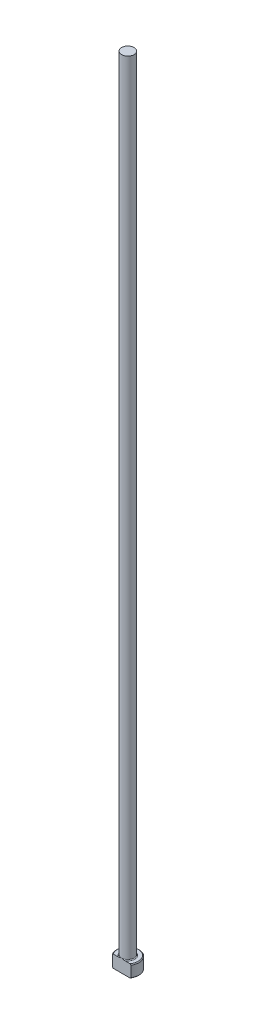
ISO-10303-21;
HEADER;
FILE_DESCRIPTION(('STEP AP214'),'2;1');
FILE_NAME('part.step','',(''),(''),'','','');
FILE_SCHEMA(('AUTOMOTIVE_DESIGN { 1 0 10303 214 1 1 1 1 }'));
ENDSEC;
DATA;
#1=APPLICATION_CONTEXT('core data for automotive mechanical design processes');
#2=APPLICATION_PROTOCOL_DEFINITION('international standard','automotive_design',2000,#1);
#3=PRODUCT_CONTEXT('',#1,'mechanical');
#4=PRODUCT('Part','Part','',(#3));
#5=PRODUCT_RELATED_PRODUCT_CATEGORY('part','',(#4));
#6=PRODUCT_DEFINITION_FORMATION('','',#4);
#7=PRODUCT_DEFINITION_CONTEXT('part definition',#1,'design');
#8=PRODUCT_DEFINITION('design','',#6,#7);
#9=PRODUCT_DEFINITION_SHAPE('','',#8);
#10=(LENGTH_UNIT() NAMED_UNIT(*) SI_UNIT(.MILLI.,.METRE.));
#11=(NAMED_UNIT(*) PLANE_ANGLE_UNIT() SI_UNIT($,.RADIAN.));
#12=(NAMED_UNIT(*) SI_UNIT($,.STERADIAN.) SOLID_ANGLE_UNIT());
#13=UNCERTAINTY_MEASURE_WITH_UNIT(LENGTH_MEASURE(1.E-05),#10,'distance_accuracy_value','');
#14=(GEOMETRIC_REPRESENTATION_CONTEXT(3) GLOBAL_UNCERTAINTY_ASSIGNED_CONTEXT((#13)) GLOBAL_UNIT_ASSIGNED_CONTEXT((#10,
#11,#12)) REPRESENTATION_CONTEXT('',''));
#15=CARTESIAN_POINT('',(0.,0.,0.));
#16=DIRECTION('',(0.,0.,1.));
#17=DIRECTION('',(1.,0.,0.));
#18=AXIS2_PLACEMENT_3D('',#15,#16,#17);
#19=CARTESIAN_POINT('',(0.,0.,0.));
#20=DIRECTION('',(0.,-1.,0.));
#21=DIRECTION('',(0.,0.,-1.));
#22=AXIS2_PLACEMENT_3D('',#19,#20,#21);
#23=PLANE('',#22);
#24=DIRECTION('',(1.,0.,0.));
#25=VECTOR('',#24,1.);
#26=CARTESIAN_POINT('',(-2.96654602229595,0.,1.98373999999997));
#27=LINE('',#26,#25);
#28=CARTESIAN_POINT('',(-2.65556240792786,0.,1.98373999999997));
#29=VERTEX_POINT('',#28);
#30=CARTESIAN_POINT('',(2.65556240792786,0.,1.98373999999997));
#31=VERTEX_POINT('',#30);
#32=EDGE_CURVE('E92',#29,#31,#27,.T.);
#33=ORIENTED_EDGE('',*,*,#32,.F.);
#34=CARTESIAN_POINT('',(0.,0.,0.));
#35=DIRECTION('',(0.,-1.,0.));
#36=DIRECTION('',(0.,0.,-1.));
#37=AXIS2_PLACEMENT_3D('',#34,#35,#36);
#38=CIRCLE('',#37,3.31469999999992);
#39=EDGE_CURVE('E105',#29,#31,#38,.T.);
#40=ORIENTED_EDGE('',*,*,#39,.T.);
#41=EDGE_LOOP('',(#33,#40));
#42=FACE_BOUND('',#41,.T.);
#43=ADVANCED_FACE('F37',(#42),#23,.T.);
#44=CARTESIAN_POINT('',(0.,259.958771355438,0.));
#45=DIRECTION('',(0.,1.,0.));
#46=DIRECTION('',(0.,0.,1.));
#47=AXIS2_PLACEMENT_3D('',#44,#45,#46);
#48=CYLINDRICAL_SURFACE('',#47,3.56869999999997);
#49=DIRECTION('',(0.,-1.,0.));
#50=VECTOR('',#49,1.);
#51=CARTESIAN_POINT('',(-2.96654602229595,254.,1.98373999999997));
#52=LINE('',#51,#50);
#53=CARTESIAN_POINT('',(-2.96654602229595,3.7084,1.98373999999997));
#54=VERTEX_POINT('',#53);
#55=CARTESIAN_POINT('',(-2.96654602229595,0.254000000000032,1.98373999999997));
#56=VERTEX_POINT('',#55);
#57=EDGE_CURVE('E95',#54,#56,#52,.T.);
#58=ORIENTED_EDGE('',*,*,#57,.F.);
#59=CARTESIAN_POINT('',(0.,3.7084,0.));
#60=DIRECTION('',(0.,1.,0.));
#61=DIRECTION('',(0.,0.,1.));
#62=AXIS2_PLACEMENT_3D('',#59,#60,#61);
#63=CIRCLE('',#62,3.56869999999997);
#64=CARTESIAN_POINT('',(2.96654602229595,3.7084,1.98373999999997));
#65=VERTEX_POINT('',#64);
#66=EDGE_CURVE('E109',#54,#65,#63,.F.);
#67=ORIENTED_EDGE('',*,*,#66,.T.);
#68=DIRECTION('',(0.,-1.,0.));
#69=VECTOR('',#68,1.);
#70=CARTESIAN_POINT('',(2.96654602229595,254.,1.98373999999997));
#71=LINE('',#70,#69);
#72=CARTESIAN_POINT('',(2.96654602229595,0.254000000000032,1.98373999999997));
#73=VERTEX_POINT('',#72);
#74=EDGE_CURVE('E187',#65,#73,#71,.T.);
#75=ORIENTED_EDGE('',*,*,#74,.T.);
#76=CARTESIAN_POINT('',(0.,0.254000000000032,0.));
#77=DIRECTION('',(0.,-1.,0.));
#78=DIRECTION('',(0.,0.,-1.));
#79=AXIS2_PLACEMENT_3D('',#76,#77,#78);
#80=CIRCLE('',#79,3.56869999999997);
#81=EDGE_CURVE('E115',#73,#56,#80,.F.);
#82=ORIENTED_EDGE('',*,*,#81,.T.);
#83=EDGE_LOOP('',(#58,#67,#75,#82));
#84=FACE_BOUND('',#83,.T.);
#85=ADVANCED_FACE('F160',(#84),#48,.T.);
#86=CARTESIAN_POINT('',(-3.56869999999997,3.9624,0.));
#87=DIRECTION('',(0.,1.,0.));
#88=DIRECTION('',(0.,0.,1.));
#89=AXIS2_PLACEMENT_3D('',#86,#87,#88);
#90=PLANE('',#89);
#91=DIRECTION('',(-1.,0.,0.));
#92=VECTOR('',#91,1.);
#93=CARTESIAN_POINT('',(-3.56869999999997,3.9624,1.98373999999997));
#94=LINE('',#93,#92);
#95=CARTESIAN_POINT('',(2.6555624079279,3.9624,1.98373999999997));
#96=VERTEX_POINT('',#95);
#97=CARTESIAN_POINT('',(1.03549790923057,3.9624,1.9837399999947));
#98=VERTEX_POINT('',#97);
#99=EDGE_CURVE('E58',#96,#98,#94,.T.);
#100=ORIENTED_EDGE('',*,*,#99,.F.);
#101=CARTESIAN_POINT('',(0.,3.9624,0.));
#102=DIRECTION('',(0.,1.,0.));
#103=DIRECTION('',(0.,0.,1.));
#104=AXIS2_PLACEMENT_3D('',#101,#102,#103);
#105=CIRCLE('',#104,3.31469999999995);
#106=CARTESIAN_POINT('',(-2.6555624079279,3.9624,1.98373999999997));
#107=VERTEX_POINT('',#106);
#108=EDGE_CURVE('E182',#96,#107,#105,.T.);
#109=ORIENTED_EDGE('',*,*,#108,.T.);
#110=CARTESIAN_POINT('',(-1.03549790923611,3.96240000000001,1.98373999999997));
#111=VERTEX_POINT('',#110);
#112=EDGE_CURVE('E140',#111,#107,#94,.T.);
#113=ORIENTED_EDGE('',*,*,#112,.F.);
#114=CARTESIAN_POINT('',(0.,3.9624,0.));
#115=DIRECTION('',(0.,1.,0.));
#116=DIRECTION('',(0.,0.,1.));
#117=AXIS2_PLACEMENT_3D('',#114,#115,#116);
#118=CIRCLE('',#117,2.23773999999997);
#119=EDGE_CURVE('E112',#111,#98,#118,.F.);
#120=ORIENTED_EDGE('',*,*,#119,.T.);
#121=EDGE_LOOP('',(#100,#109,#113,#120));
#122=FACE_BOUND('',#121,.T.);
#123=ADVANCED_FACE('F164',(#122),#90,.T.);
#124=CARTESIAN_POINT('',(0.,259.958771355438,0.));
#125=DIRECTION('',(0.,1.,0.));
#126=DIRECTION('',(0.,0.,1.));
#127=AXIS2_PLACEMENT_3D('',#124,#125,#126);
#128=CYLINDRICAL_SURFACE('',#127,1.98373999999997);
#129=CARTESIAN_POINT('',(0.,4.21640000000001,0.));
#130=DIRECTION('',(0.,1.,0.));
#131=DIRECTION('',(0.,0.,1.));
#132=AXIS2_PLACEMENT_3D('',#129,#130,#131);
#133=CIRCLE('',#132,1.98373999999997);
#134=CARTESIAN_POINT('',(0.,4.21640000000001,1.98373999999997));
#135=VERTEX_POINT('',#134);
#136=EDGE_CURVE('E108',#135,#135,#133,.T.);
#137=ORIENTED_EDGE('',*,*,#136,.T.);
#138=EDGE_LOOP('',(#137));
#139=FACE_BOUND('',#138,.T.);
#140=CARTESIAN_POINT('',(0.,254.,0.));
#141=DIRECTION('',(0.,1.,0.));
#142=DIRECTION('',(0.,0.,1.));
#143=AXIS2_PLACEMENT_3D('',#140,#141,#142);
#144=CIRCLE('',#143,1.98373999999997);
#145=CARTESIAN_POINT('',(0.,254.,1.98373999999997));
#146=VERTEX_POINT('',#145);
#147=EDGE_CURVE('E100',#146,#146,#144,.T.);
#148=ORIENTED_EDGE('',*,*,#147,.F.);
#149=EDGE_LOOP('',(#148));
#150=FACE_BOUND('',#149,.T.);
#151=ADVANCED_FACE('F169',(#139,#150),#128,.T.);
#152=CARTESIAN_POINT('',(-1.98373999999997,254.,0.));
#153=DIRECTION('',(0.,1.,0.));
#154=DIRECTION('',(0.,0.,1.));
#155=AXIS2_PLACEMENT_3D('',#152,#153,#154);
#156=PLANE('',#155);
#157=ORIENTED_EDGE('',*,*,#147,.T.);
#158=EDGE_LOOP('',(#157));
#159=FACE_BOUND('',#158,.T.);
#160=ADVANCED_FACE('F127',(#159),#156,.T.);
#161=CARTESIAN_POINT('',(0.,3.96239999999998,0.));
#162=DIRECTION('',(0.,-1.,0.));
#163=DIRECTION('',(0.,0.,-1.));
#164=AXIS2_PLACEMENT_3D('',#161,#162,#163);
#165=CONICAL_SURFACE('',#164,3.31469999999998,0.78539816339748);
#166=CARTESIAN_POINT('',(2.96724602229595,3.70781809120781,1.98373999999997));
#167=CARTESIAN_POINT('',(2.86672695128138,3.7913253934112,1.98373999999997));
#168=CARTESIAN_POINT('',(2.76560417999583,3.87413188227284,1.98373999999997));
#169=CARTESIAN_POINT('',(2.56161541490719,4.0377668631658,1.98373999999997));
#170=CARTESIAN_POINT('',(2.45874784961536,4.11859339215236,1.98373999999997));
#171=CARTESIAN_POINT('',(2.2484941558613,4.2793883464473,1.98373999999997));
#172=CARTESIAN_POINT('',(2.14105861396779,4.35929251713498,1.98373999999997));
#173=CARTESIAN_POINT('',(1.92334877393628,4.51509190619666,1.98373999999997));
#174=CARTESIAN_POINT('',(1.81307555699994,4.59098861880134,1.98373999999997));
#175=CARTESIAN_POINT('',(1.61917748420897,4.7171926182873,1.98373999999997));
#176=CARTESIAN_POINT('',(1.53643977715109,4.76885588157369,1.98373999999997));
#177=CARTESIAN_POINT('',(1.36853089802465,4.86805297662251,1.98373999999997));
#178=CARTESIAN_POINT('',(1.28336045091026,4.91558802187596,1.98373999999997));
#179=CARTESIAN_POINT('',(1.11060273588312,5.00482765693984,1.98373999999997));
#180=CARTESIAN_POINT('',(1.0230321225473,5.04656410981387,1.98373999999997));
#181=CARTESIAN_POINT('',(0.844684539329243,5.12251752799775,1.98373999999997));
#182=CARTESIAN_POINT('',(0.753910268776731,5.15674065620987,1.98373999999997));
#183=CARTESIAN_POINT('',(0.603497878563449,5.20432307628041,1.98373999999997));
#184=CARTESIAN_POINT('',(0.544819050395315,5.22071027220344,1.98373999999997));
#185=CARTESIAN_POINT('',(0.426373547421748,5.24887069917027,1.98373999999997));
#186=CARTESIAN_POINT('',(0.366607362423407,5.26064595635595,1.98373999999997));
#187=CARTESIAN_POINT('',(0.246447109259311,5.27898890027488,1.98373999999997));
#188=CARTESIAN_POINT('',(0.186055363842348,5.28557158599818,1.98373999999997));
#189=CARTESIAN_POINT('',(0.0649198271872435,5.29321823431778,1.98373999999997));
#190=CARTESIAN_POINT('',(0.00417605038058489,5.29428242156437,1.98373999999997));
#191=CARTESIAN_POINT('',(-0.117214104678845,5.29082761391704,1.98373999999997));
#192=CARTESIAN_POINT('',(-0.177860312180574,5.28630271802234,1.98373999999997));
#193=CARTESIAN_POINT('',(-0.298512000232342,5.27192078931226,1.98373999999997));
#194=CARTESIAN_POINT('',(-0.358517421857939,5.2620632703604,1.98373999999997));
#195=CARTESIAN_POINT('',(-0.477735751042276,5.2374830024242,1.98373999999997));
#196=CARTESIAN_POINT('',(-0.536945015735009,5.22274281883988,1.98373999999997));
#197=CARTESIAN_POINT('',(-0.654133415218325,5.18904660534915,1.98373999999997));
#198=CARTESIAN_POINT('',(-0.712112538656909,5.1700905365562,1.98373999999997));
#199=CARTESIAN_POINT('',(-0.904629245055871,5.10048538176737,1.98373999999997));
#200=CARTESIAN_POINT('',(-1.03624061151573,5.04174784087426,1.98373999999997));
#201=CARTESIAN_POINT('',(-1.29313693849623,4.91170252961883,1.98373999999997));
#202=CARTESIAN_POINT('',(-1.41840716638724,4.84036707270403,1.98373999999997));
#203=CARTESIAN_POINT('',(-1.66480293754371,4.68918546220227,1.98373999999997));
#204=CARTESIAN_POINT('',(-1.78589487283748,4.60928521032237,1.98373999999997));
#205=CARTESIAN_POINT('',(-2.02421015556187,4.44420594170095,1.98373999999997));
#206=CARTESIAN_POINT('',(-2.14143690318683,4.35903176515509,1.98373999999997));
#207=CARTESIAN_POINT('',(-2.37887141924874,4.18067980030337,1.98373999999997));
#208=CARTESIAN_POINT('',(-2.49893764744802,4.0873146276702,1.98373999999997));
#209=CARTESIAN_POINT('',(-2.67660513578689,3.94570491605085,1.98373999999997));
#210=CARTESIAN_POINT('',(-2.73507077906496,3.89853553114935,1.98373999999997));
#211=CARTESIAN_POINT('',(-2.85150939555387,3.80360086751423,1.98373999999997));
#212=CARTESIAN_POINT('',(-2.90948240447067,3.75583563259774,1.98373999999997));
#213=CARTESIAN_POINT('',(-2.96724602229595,3.70781809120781,1.98373999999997));
#214=B_SPLINE_CURVE_WITH_KNOTS('',3,(#166,#167,#168,#169,#170,#171,#172,#173,#174,#175,#176,
#177,#178,#179,#180,#181,#182,#183,#184,#185,#186,#187,#188,#189,#190,#191,#192,#193,#194,#195,
#196,#197,#198,#199,#200,#201,#202,#203,#204,#205,#206,#207,#208,#209,#210,#211,#212,#213),
.UNSPECIFIED.,.F.,.F.,(4,2,2,2,2,2,2,2,2,2,2,2,2,2,2,2,2,2,2,2,2,2,2,4),(0.,0.39206528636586,
0.784504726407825,1.1861202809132,1.58758501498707,1.88012833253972,2.17258536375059,
2.46336577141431,2.75390676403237,2.93652450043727,3.11906191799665,3.30107011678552,
3.48307090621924,3.66526401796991,3.84747374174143,4.0303412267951,4.2132103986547,
4.64434716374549,5.07644350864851,5.51145085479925,5.94606472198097,6.40228573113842,
6.62764643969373,6.85299067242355),.UNSPECIFIED.);
#215=EDGE_CURVE('E63',#65,#96,#214,.T.);
#216=ORIENTED_EDGE('',*,*,#215,.F.);
#217=ORIENTED_EDGE('',*,*,#66,.F.);
#218=EDGE_CURVE('E133',#107,#54,#214,.T.);
#219=ORIENTED_EDGE('',*,*,#218,.F.);
#220=ORIENTED_EDGE('',*,*,#108,.F.);
#221=EDGE_LOOP('',(#216,#217,#219,#220));
#222=FACE_BOUND('',#221,.T.);
#223=ADVANCED_FACE('F147',(#222),#165,.T.);
#224=CARTESIAN_POINT('',(0.,0.254000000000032,0.));
#225=DIRECTION('',(0.,1.,0.));
#226=DIRECTION('',(0.,0.,1.));
#227=AXIS2_PLACEMENT_3D('',#224,#225,#226);
#228=CONICAL_SURFACE('',#227,3.56869999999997,0.78539816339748);
#229=CARTESIAN_POINT('',(-2.96724602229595,0.254581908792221,1.98373999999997));
#230=CARTESIAN_POINT('',(-2.86672695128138,0.171074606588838,1.98373999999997));
#231=CARTESIAN_POINT('',(-2.76560417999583,0.0882681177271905,1.98373999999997));
#232=CARTESIAN_POINT('',(-2.56161541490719,-0.0753668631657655,1.98373999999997));
#233=CARTESIAN_POINT('',(-2.45874784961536,-0.156193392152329,1.98373999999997));
#234=CARTESIAN_POINT('',(-2.2484941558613,-0.316988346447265,1.98373999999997));
#235=CARTESIAN_POINT('',(-2.14105861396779,-0.396892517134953,1.98373999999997));
#236=CARTESIAN_POINT('',(-1.92334877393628,-0.552691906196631,1.98373999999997));
#237=CARTESIAN_POINT('',(-1.81307555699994,-0.628588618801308,1.98373999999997));
#238=CARTESIAN_POINT('',(-1.61917748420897,-0.754792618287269,1.98373999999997));
#239=CARTESIAN_POINT('',(-1.53643977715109,-0.80645588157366,1.98373999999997));
#240=CARTESIAN_POINT('',(-1.36853089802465,-0.905652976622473,1.98373999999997));
#241=CARTESIAN_POINT('',(-1.28336045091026,-0.953188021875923,1.98373999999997));
#242=CARTESIAN_POINT('',(-1.11060273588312,-1.04242765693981,1.98373999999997));
#243=CARTESIAN_POINT('',(-1.0230321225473,-1.08416410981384,1.98373999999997));
#244=CARTESIAN_POINT('',(-0.844684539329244,-1.16011752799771,1.98373999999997));
#245=CARTESIAN_POINT('',(-0.753910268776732,-1.19434065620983,1.98373999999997));
#246=CARTESIAN_POINT('',(-0.603497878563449,-1.24192307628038,1.98373999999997));
#247=CARTESIAN_POINT('',(-0.544819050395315,-1.2583102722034,1.98373999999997));
#248=CARTESIAN_POINT('',(-0.426373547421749,-1.28647069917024,1.98373999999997));
#249=CARTESIAN_POINT('',(-0.366607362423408,-1.29824595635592,1.98373999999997));
#250=CARTESIAN_POINT('',(-0.246447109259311,-1.31658890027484,1.98373999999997));
#251=CARTESIAN_POINT('',(-0.186055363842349,-1.32317158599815,1.98373999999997));
#252=CARTESIAN_POINT('',(-0.0649198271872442,-1.33081823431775,1.98373999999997));
#253=CARTESIAN_POINT('',(-0.00417605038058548,-1.33188242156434,1.98373999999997));
#254=CARTESIAN_POINT('',(0.117214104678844,-1.32842761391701,1.98373999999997));
#255=CARTESIAN_POINT('',(0.177860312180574,-1.32390271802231,1.98373999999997));
#256=CARTESIAN_POINT('',(0.298512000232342,-1.30952078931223,1.98373999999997));
#257=CARTESIAN_POINT('',(0.358517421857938,-1.29966327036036,1.98373999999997));
#258=CARTESIAN_POINT('',(0.477735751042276,-1.27508300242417,1.98373999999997));
#259=CARTESIAN_POINT('',(0.536945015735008,-1.26034281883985,1.98373999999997));
#260=CARTESIAN_POINT('',(0.654133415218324,-1.22664660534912,1.98373999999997));
#261=CARTESIAN_POINT('',(0.712112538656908,-1.20769053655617,1.98373999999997));
#262=CARTESIAN_POINT('',(0.904629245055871,-1.13808538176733,1.98373999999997));
#263=CARTESIAN_POINT('',(1.03624061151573,-1.07934784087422,1.98373999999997));
#264=CARTESIAN_POINT('',(1.29313693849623,-0.949302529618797,1.98373999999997));
#265=CARTESIAN_POINT('',(1.41840716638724,-0.877967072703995,1.98373999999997));
#266=CARTESIAN_POINT('',(1.66480293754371,-0.726785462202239,1.98373999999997));
#267=CARTESIAN_POINT('',(1.78589487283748,-0.646885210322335,1.98373999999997));
#268=CARTESIAN_POINT('',(2.02421015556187,-0.48180594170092,1.98373999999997));
#269=CARTESIAN_POINT('',(2.14143690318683,-0.396631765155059,1.98373999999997));
#270=CARTESIAN_POINT('',(2.37887141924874,-0.218279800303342,1.98373999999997));
#271=CARTESIAN_POINT('',(2.49893764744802,-0.124914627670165,1.98373999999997));
#272=CARTESIAN_POINT('',(2.67660513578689,0.0166950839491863,1.98373999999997));
#273=CARTESIAN_POINT('',(2.73507077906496,0.0638644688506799,1.98373999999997));
#274=CARTESIAN_POINT('',(2.85150939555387,0.1587991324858,1.98373999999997));
#275=CARTESIAN_POINT('',(2.90948240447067,0.206564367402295,1.98373999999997));
#276=CARTESIAN_POINT('',(2.96724602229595,0.254581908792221,1.98373999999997));
#277=B_SPLINE_CURVE_WITH_KNOTS('',3,(#229,#230,#231,#232,#233,#234,#235,#236,#237,#238,#239,
#240,#241,#242,#243,#244,#245,#246,#247,#248,#249,#250,#251,#252,#253,#254,#255,#256,#257,#258,
#259,#260,#261,#262,#263,#264,#265,#266,#267,#268,#269,#270,#271,#272,#273,#274,#275,#276),
.UNSPECIFIED.,.F.,.F.,(4,2,2,2,2,2,2,2,2,2,2,2,2,2,2,2,2,2,2,2,2,2,2,4),(0.,0.392065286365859,
0.784504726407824,1.1861202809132,1.58758501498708,1.88012833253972,2.17258536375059,
2.46336577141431,2.75390676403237,2.93652450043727,3.11906191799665,3.30107011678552,
3.48307090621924,3.66526401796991,3.84747374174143,4.0303412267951,4.2132103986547,
4.64434716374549,5.07644350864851,5.51145085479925,5.94606472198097,6.40228573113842,
6.62764643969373,6.85299067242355),.UNSPECIFIED.);
#278=EDGE_CURVE('E89',#56,#29,#277,.T.);
#279=ORIENTED_EDGE('',*,*,#278,.F.);
#280=ORIENTED_EDGE('',*,*,#81,.F.);
#281=EDGE_CURVE('E101',#31,#73,#277,.T.);
#282=ORIENTED_EDGE('',*,*,#281,.F.);
#283=ORIENTED_EDGE('',*,*,#39,.F.);
#284=EDGE_LOOP('',(#279,#280,#282,#283));
#285=FACE_BOUND('',#284,.T.);
#286=ADVANCED_FACE('F107',(#285),#228,.T.);
#287=CARTESIAN_POINT('',(0.,4.21640000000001,0.));
#288=DIRECTION('',(0.,1.,0.));
#289=DIRECTION('',(0.,0.,1.));
#290=AXIS2_PLACEMENT_3D('',#287,#288,#289);
#291=TOROIDAL_SURFACE('',#290,2.23773999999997,0.254);
#292=ORIENTED_EDGE('',*,*,#119,.F.);
#293=CARTESIAN_POINT('',(0.,4.21640000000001,1.98373999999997));
#294=CARTESIAN_POINT('',(4.02307017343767E-11,4.21640057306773,1.98373999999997));
#295=CARTESIAN_POINT('',(-1.40828581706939E-07,4.21640114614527,1.98373999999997));
#296=CARTESIAN_POINT('',(-5.7339269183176E-07,4.21640224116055,1.98373999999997));
#297=CARTESIAN_POINT('',(-8.70731400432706E-07,4.21640276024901,1.98373999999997));
#298=CARTESIAN_POINT('',(-1.58225797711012E-06,4.21640380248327,1.98373999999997));
#299=CARTESIAN_POINT('',(-2.00604119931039E-06,4.21640431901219,1.98373999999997));
#300=CARTESIAN_POINT('',(-2.91133999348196E-06,4.21640528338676,1.98373999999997));
#301=CARTESIAN_POINT('',(-3.39207133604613E-06,4.21640573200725,1.98373999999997));
#302=CARTESIAN_POINT('',(-5.14628594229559E-06,4.21640727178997,1.98373999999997));
#303=CARTESIAN_POINT('',(-6.49332487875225E-06,4.21640828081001,1.98373999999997));
#304=CARTESIAN_POINT('',(-9.24843947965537E-06,4.21641004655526,1.98373999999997));
#305=CARTESIAN_POINT('',(-1.06506929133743E-05,4.21641081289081,1.98373999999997));
#306=CARTESIAN_POINT('',(-1.62369385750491E-05,4.21641377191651,1.98373999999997));
#307=CARTESIAN_POINT('',(-2.04997858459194E-05,4.2164158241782,1.98373999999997));
#308=CARTESIAN_POINT('',(-2.88176617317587E-05,4.21641910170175,1.98373999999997));
#309=CARTESIAN_POINT('',(-3.28481085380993E-05,4.21642039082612,1.98373999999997));
#310=CARTESIAN_POINT('',(-5.03242637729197E-05,4.21642599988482,1.98373999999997));
#311=CARTESIAN_POINT('',(-6.37475444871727E-05,4.21643035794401,1.98373999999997));
#312=CARTESIAN_POINT('',(-8.86866389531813E-05,4.21643721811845,1.98373999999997));
#313=CARTESIAN_POINT('',(-0.000100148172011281,4.21643990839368,1.98373999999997));
#314=CARTESIAN_POINT('',(-0.000184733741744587,4.21646156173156,1.98373999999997));
#315=CARTESIAN_POINT('',(-0.0002551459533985,4.21648964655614,1.98373999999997));
#316=CARTESIAN_POINT('',(-0.000530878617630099,4.21659565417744,1.98373999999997));
#317=CARTESIAN_POINT('',(-0.000738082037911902,4.21666677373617,1.98373999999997));
#318=CARTESIAN_POINT('',(-0.00154925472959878,4.21694925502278,1.98373999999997));
#319=CARTESIAN_POINT('',(-0.00215130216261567,4.21716774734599,1.98373999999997));
#320=CARTESIAN_POINT('',(-0.00462988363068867,4.21806309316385,1.98373999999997));
#321=CARTESIAN_POINT('',(-0.00650853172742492,4.21873189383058,1.98373999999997));
#322=CARTESIAN_POINT('',(-0.0303581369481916,4.22722764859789,1.98373999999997));
#323=CARTESIAN_POINT('',(-0.0523158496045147,4.23510626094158,1.98373999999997));
#324=CARTESIAN_POINT('',(-0.0954269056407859,4.25047917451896,1.98373999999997));
#325=CARTESIAN_POINT('',(-0.11657919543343,4.25797672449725,1.98373999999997));
#326=CARTESIAN_POINT('',(-0.161458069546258,4.27377445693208,1.98373999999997));
#327=CARTESIAN_POINT('',(-0.185188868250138,4.28206294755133,1.98373999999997));
#328=CARTESIAN_POINT('',(-0.232964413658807,4.29853259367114,1.98373999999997));
#329=CARTESIAN_POINT('',(-0.257009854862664,4.30671173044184,1.98373999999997));
#330=CARTESIAN_POINT('',(-0.316193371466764,4.32648112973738,1.98373999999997));
#331=CARTESIAN_POINT('',(-0.3513814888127,4.33792303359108,1.98373999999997));
#332=CARTESIAN_POINT('',(-0.421152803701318,4.35974103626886,1.98373999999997));
#333=CARTESIAN_POINT('',(-0.455729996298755,4.37013624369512,1.98373999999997));
#334=CARTESIAN_POINT('',(-0.532487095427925,4.39200885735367,1.98373999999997));
#335=CARTESIAN_POINT('',(-0.574734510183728,4.4032531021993,1.98373999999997));
#336=CARTESIAN_POINT('',(-0.6600384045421,4.42385016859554,1.98373999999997));
#337=CARTESIAN_POINT('',(-0.703098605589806,4.43318780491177,1.98373999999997));
#338=CARTESIAN_POINT('',(-0.792838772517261,4.44980860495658,1.98373999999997));
#339=CARTESIAN_POINT('',(-0.83955648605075,4.45689590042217,1.98373999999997));
#340=CARTESIAN_POINT('',(-0.933305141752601,4.46701113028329,1.98373999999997));
#341=CARTESIAN_POINT('',(-0.980334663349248,4.47005158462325,1.98373999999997));
#342=CARTESIAN_POINT('',(-1.07363680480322,4.47068781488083,1.98373999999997));
#343=CARTESIAN_POINT('',(-1.11990681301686,4.46838602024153,1.98373999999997));
#344=CARTESIAN_POINT('',(-1.18820667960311,4.45949572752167,1.98373999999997));
#345=CARTESIAN_POINT('',(-1.21059706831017,4.45568261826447,1.98373999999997));
#346=CARTESIAN_POINT('',(-1.25489724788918,4.44592513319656,1.98373999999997));
#347=CARTESIAN_POINT('',(-1.27680769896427,4.43998390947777,1.98373999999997));
#348=CARTESIAN_POINT('',(-1.31298334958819,4.42779727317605,1.98373999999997));
#349=CARTESIAN_POINT('',(-1.32747926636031,4.42223947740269,1.98373999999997));
#350=CARTESIAN_POINT('',(-1.35590450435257,4.40970381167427,1.98373999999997));
#351=CARTESIAN_POINT('',(-1.36983212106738,4.40272199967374,1.98373999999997));
#352=CARTESIAN_POINT('',(-1.39685784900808,4.38707849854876,1.98373999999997));
#353=CARTESIAN_POINT('',(-1.40994935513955,4.37840521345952,1.98373999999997));
#354=CARTESIAN_POINT('',(-1.43467906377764,4.35918713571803,1.98373999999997));
#355=CARTESIAN_POINT('',(-1.44632058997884,4.34864676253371,1.98373999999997));
#356=CARTESIAN_POINT('',(-1.46405523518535,4.32920735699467,1.98373999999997));
#357=CARTESIAN_POINT('',(-1.47073699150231,4.32084820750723,1.98373999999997));
#358=CARTESIAN_POINT('',(-1.48274781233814,4.30319678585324,1.98373999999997));
#359=CARTESIAN_POINT('',(-1.48807744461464,4.29390490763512,1.98373999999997));
#360=CARTESIAN_POINT('',(-1.49706189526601,4.27440249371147,1.98373999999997));
#361=CARTESIAN_POINT('',(-1.50069745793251,4.2641829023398,1.98373999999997));
#362=CARTESIAN_POINT('',(-1.50584635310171,4.24322268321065,1.98373999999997));
#363=CARTESIAN_POINT('',(-1.50736266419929,4.23248280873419,1.98373999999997));
#364=CARTESIAN_POINT('',(-1.50805409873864,4.21251978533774,1.98373999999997));
#365=CARTESIAN_POINT('',(-1.50754134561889,4.2033063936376,1.98373999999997));
#366=CARTESIAN_POINT('',(-1.50490308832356,4.18511471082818,1.98373999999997));
#367=CARTESIAN_POINT('',(-1.50277735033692,4.17613645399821,1.98373999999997));
#368=CARTESIAN_POINT('',(-1.49719456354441,4.15900798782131,1.98373999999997));
#369=CARTESIAN_POINT('',(-1.49379391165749,4.15083904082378,1.98373999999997));
#370=CARTESIAN_POINT('',(-1.48586548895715,4.13507450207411,1.98373999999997));
#371=CARTESIAN_POINT('',(-1.48133740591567,4.12747906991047,1.98373999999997));
#372=CARTESIAN_POINT('',(-1.46862962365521,4.10893969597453,1.98373999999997));
#373=CARTESIAN_POINT('',(-1.45980714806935,4.09843603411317,1.98373999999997));
#374=CARTESIAN_POINT('',(-1.44060965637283,4.07895123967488,1.98373999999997));
#375=CARTESIAN_POINT('',(-1.43023007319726,4.0699747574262,1.98373999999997));
#376=CARTESIAN_POINT('',(-1.40223517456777,4.04875837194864,1.98373999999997));
#377=CARTESIAN_POINT('',(-1.38384742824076,4.03754372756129,1.98373999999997));
#378=CARTESIAN_POINT('',(-1.34565665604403,4.0180221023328,1.98373999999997));
#379=CARTESIAN_POINT('',(-1.32585336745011,4.00971566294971,1.98373999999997));
#380=CARTESIAN_POINT('',(-1.26986203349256,3.98996652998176,1.98373999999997));
#381=CARTESIAN_POINT('',(-1.23279835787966,3.98103330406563,1.98373999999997));
#382=CARTESIAN_POINT('',(-1.15741515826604,3.96843140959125,1.98373999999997));
#383=CARTESIAN_POINT('',(-1.1190855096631,3.96483389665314,1.98373999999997));
#384=CARTESIAN_POINT('',(-1.040510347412,3.96167833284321,1.98373999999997));
#385=CARTESIAN_POINT('',(-1.00025822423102,3.96231482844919,1.98373999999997));
#386=CARTESIAN_POINT('',(-0.919878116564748,3.96702722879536,1.98373999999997));
#387=CARTESIAN_POINT('',(-0.879750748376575,3.97111229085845,1.98373999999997));
#388=CARTESIAN_POINT('',(-0.802049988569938,3.98166551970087,1.98373999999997));
#389=CARTESIAN_POINT('',(-0.764456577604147,3.98799169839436,1.98373999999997));
#390=CARTESIAN_POINT('',(-0.689886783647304,4.00249311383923,1.98373999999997));
#391=CARTESIAN_POINT('',(-0.652907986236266,4.0106561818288,1.98373999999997));
#392=CARTESIAN_POINT('',(-0.571827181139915,4.03026785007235,1.98373999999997));
#393=CARTESIAN_POINT('',(-0.527806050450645,4.04204700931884,1.98373999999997));
#394=CARTESIAN_POINT('',(-0.439166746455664,4.06747597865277,1.98373999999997));
#395=CARTESIAN_POINT('',(-0.394559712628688,4.08116399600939,1.98373999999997));
#396=CARTESIAN_POINT('',(-0.319865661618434,4.10513097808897,1.98373999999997));
#397=CARTESIAN_POINT('',(-0.28968006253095,4.11510679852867,1.98373999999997));
#398=CARTESIAN_POINT('',(-0.229752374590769,4.1353375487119,1.98373999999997));
#399=CARTESIAN_POINT('',(-0.200008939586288,4.14558849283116,1.98373999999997));
#400=CARTESIAN_POINT('',(-0.143797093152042,4.16520591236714,1.98373999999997));
#401=CARTESIAN_POINT('',(-0.117320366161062,4.17454899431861,1.98373999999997));
#402=CARTESIAN_POINT('',(-0.0633624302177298,4.19374573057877,1.98373999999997));
#403=CARTESIAN_POINT('',(-0.0358830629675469,4.20360493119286,1.98373999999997));
#404=CARTESIAN_POINT('',(-0.00650762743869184,4.21406838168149,1.98373999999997));
#405=CARTESIAN_POINT('',(-0.00462809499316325,4.21473753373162,1.98373999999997));
#406=CARTESIAN_POINT('',(-0.00214930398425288,4.21563296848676,1.98373999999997));
#407=CARTESIAN_POINT('',(-0.00154793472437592,4.21585121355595,1.98373999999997));
#408=CARTESIAN_POINT('',(-0.000737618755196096,4.21613339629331,1.98373999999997));
#409=CARTESIAN_POINT('',(-0.000530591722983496,4.21620445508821,1.98373999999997));
#410=CARTESIAN_POINT('',(-0.000255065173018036,4.21631038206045,1.98373999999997));
#411=CARTESIAN_POINT('',(-0.000184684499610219,4.21633845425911,1.98373999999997));
#412=CARTESIAN_POINT('',(-0.000100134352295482,4.21636010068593,1.98373999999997));
#413=CARTESIAN_POINT('',(-8.86750306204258E-05,4.21636279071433,1.98373999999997));
#414=CARTESIAN_POINT('',(-6.37408791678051E-05,4.2163696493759,1.98373999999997));
#415=CARTESIAN_POINT('',(-5.03202712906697E-05,4.21637400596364,1.98373999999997));
#416=CARTESIAN_POINT('',(-3.2847107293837E-05,4.21637961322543,1.98373999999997));
#417=CARTESIAN_POINT('',(-2.88169884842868E-05,4.21638090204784,1.98373999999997));
#418=CARTESIAN_POINT('',(-2.04997436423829E-05,4.21638417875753,1.98373999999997));
#419=CARTESIAN_POINT('',(-1.62371861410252E-05,4.21638623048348,1.98373999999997));
#420=CARTESIAN_POINT('',(-1.06512202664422E-05,4.21638918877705,1.98373999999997));
#421=CARTESIAN_POINT('',(-9.24899206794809E-06,4.21638995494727,1.98373999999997));
#422=CARTESIAN_POINT('',(-6.49389610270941E-06,4.21639172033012,1.98373999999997));
#423=CARTESIAN_POINT('',(-5.14684846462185E-06,4.21639272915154,1.98373999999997));
#424=CARTESIAN_POINT('',(-3.39258419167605E-06,4.21639426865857,1.98373999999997));
#425=CARTESIAN_POINT('',(-2.91183082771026E-06,4.21639471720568,1.98373999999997));
#426=CARTESIAN_POINT('',(-2.00647479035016E-06,4.21639568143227,1.98373999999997));
#427=CARTESIAN_POINT('',(-1.5826561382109E-06,4.21639619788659,1.98373999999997));
#428=CARTESIAN_POINT('',(-8.71044273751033E-07,4.21639723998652,1.98373999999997));
#429=CARTESIAN_POINT('',(-5.73657832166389E-07,4.21639775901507,1.98373999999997));
#430=CARTESIAN_POINT('',(-1.40976930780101E-07,4.21639885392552,1.98373999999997));
#431=CARTESIAN_POINT('',(-4.02289072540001E-11,4.21639942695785,1.98373999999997));
#432=CARTESIAN_POINT('',(0.,4.21640000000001,1.98373999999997));
#433=B_SPLINE_CURVE_WITH_KNOTS('',3,(#293,#294,#295,#296,#297,#298,#299,#300,#301,#302,#303,
#304,#305,#306,#307,#308,#309,#310,#311,#312,#313,#314,#315,#316,#317,#318,#319,#320,#321,#322,
#323,#324,#325,#326,#327,#328,#329,#330,#331,#332,#333,#334,#335,#336,#337,#338,#339,#340,#341,
#342,#343,#344,#345,#346,#347,#348,#349,#350,#351,#352,#353,#354,#355,#356,#357,#358,#359,#360,
#361,#362,#363,#364,#365,#366,#367,#368,#369,#370,#371,#372,#373,#374,#375,#376,#377,#378,#379,
#380,#381,#382,#383,#384,#385,#386,#387,#388,#389,#390,#391,#392,#393,#394,#395,#396,#397,#398,
#399,#400,#401,#402,#403,#404,#405,#406,#407,#408,#409,#410,#411,#412,#413,#414,#415,#416,#417,
#418,#419,#420,#421,#422,#423,#424,#425,#426,#427,#428,#429,#430,#431,#432),.UNSPECIFIED.,.T.,
.F.,(4,2,2,2,2,2,2,2,2,2,2,2,2,2,2,2,2,2,2,2,2,2,2,2,2,2,2,2,2,2,2,2,2,2,2,2,2,2,2,2,2,2,2,2,2,
2,2,2,2,2,2,2,2,2,2,2,2,2,2,2,2,2,2,2,2,2,2,2,2,4),(0.,1.71984197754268E-06,3.5064557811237E-06,
5.50188707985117E-06,7.47248185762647E-06,1.24982124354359E-05,1.7288326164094E-05,
3.14431062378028E-05,4.41239559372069E-05,8.64578801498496E-05,0.000121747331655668,
0.000348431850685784,0.00100625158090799,0.00292688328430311,0.00891015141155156,
0.0788889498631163,0.146215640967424,0.221624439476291,0.297819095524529,0.408816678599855,
0.517124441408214,0.64824249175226,0.780367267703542,0.921987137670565,1.06316784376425,
1.20166404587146,1.26972615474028,1.33768786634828,1.38420339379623,1.4308494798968,
1.47782736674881,1.5246955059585,1.55669718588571,1.58868540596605,1.62102884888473,
1.65332678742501,1.68086440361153,1.70840601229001,1.73485066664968,1.76130265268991,
1.80222010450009,1.84326000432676,1.90750875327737,1.97176945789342,2.08550754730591,
2.2007491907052,2.32132144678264,2.4422148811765,2.55652068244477,2.67009044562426,
2.80675839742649,2.946716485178,3.04208779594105,3.13646648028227,3.2206986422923,
3.30827404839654,3.31426016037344,3.31617862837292,3.31683588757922,3.31706247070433,
3.31709775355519,3.31714007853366,3.31715275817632,3.31716691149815,3.31717170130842,
3.31717672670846,3.31717869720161,3.31718069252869,3.31718247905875,3.31718419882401),.UNSPECIFIED.);
#434=EDGE_CURVE('E11',#111,#135,#433,.T.);
#435=ORIENTED_EDGE('',*,*,#434,.T.);
#436=ORIENTED_EDGE('',*,*,#136,.F.);
#437=CARTESIAN_POINT('',(0.,4.21640000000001,1.98373999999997));
#438=CARTESIAN_POINT('',(-4.02307140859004E-11,4.21639942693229,1.98373999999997));
#439=CARTESIAN_POINT('',(1.40828581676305E-07,4.21639885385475,1.98373999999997));
#440=CARTESIAN_POINT('',(5.73392691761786E-07,4.21639775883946,1.98373999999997));
#441=CARTESIAN_POINT('',(8.70731400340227E-07,4.21639723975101,1.98373999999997));
#442=CARTESIAN_POINT('',(1.58225797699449E-06,4.21639619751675,1.98373999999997));
#443=CARTESIAN_POINT('',(2.00604119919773E-06,4.21639568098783,1.98373999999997));
#444=CARTESIAN_POINT('',(2.91133999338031E-06,4.21639471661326,1.98373999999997));
#445=CARTESIAN_POINT('',(3.39207133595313E-06,4.21639426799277,1.98373999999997));
#446=CARTESIAN_POINT('',(5.14628594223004E-06,4.21639272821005,1.98373999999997));
#447=CARTESIAN_POINT('',(6.49332487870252E-06,4.21639171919,1.98373999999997));
#448=CARTESIAN_POINT('',(9.24843947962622E-06,4.21638995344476,1.98373999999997));
#449=CARTESIAN_POINT('',(1.06506929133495E-05,4.21638918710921,1.98373999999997));
#450=CARTESIAN_POINT('',(1.62369385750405E-05,4.21638622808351,1.98373999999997));
#451=CARTESIAN_POINT('',(2.04997858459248E-05,4.21638417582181,1.98373999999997));
#452=CARTESIAN_POINT('',(2.88176617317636E-05,4.21638089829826,1.98373999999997));
#453=CARTESIAN_POINT('',(3.28481085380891E-05,4.2163796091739,1.98373999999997));
#454=CARTESIAN_POINT('',(5.03242637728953E-05,4.2163740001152,1.98373999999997));
#455=CARTESIAN_POINT('',(6.37475444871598E-05,4.216369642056,1.98373999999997));
#456=CARTESIAN_POINT('',(8.86866389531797E-05,4.21636278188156,1.98373999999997));
#457=CARTESIAN_POINT('',(0.00010014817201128,4.21636009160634,1.98373999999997));
#458=CARTESIAN_POINT('',(0.000184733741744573,4.21633843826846,1.98373999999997));
#459=CARTESIAN_POINT('',(0.000255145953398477,4.21631035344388,1.98373999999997));
#460=CARTESIAN_POINT('',(0.000530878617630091,4.21620434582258,1.98373999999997));
#461=CARTESIAN_POINT('',(0.000738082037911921,4.21613322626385,1.98373999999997));
#462=CARTESIAN_POINT('',(0.00154925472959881,4.21585074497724,1.98373999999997));
#463=CARTESIAN_POINT('',(0.00215130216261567,4.21563225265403,1.98373999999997));
#464=CARTESIAN_POINT('',(0.00462988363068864,4.21473690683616,1.98373999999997));
#465=CARTESIAN_POINT('',(0.0065085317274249,4.21406810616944,1.98373999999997));
#466=CARTESIAN_POINT('',(0.0303581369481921,4.20557235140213,1.98373999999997));
#467=CARTESIAN_POINT('',(0.0523158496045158,4.19769373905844,1.98373999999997));
#468=CARTESIAN_POINT('',(0.0954269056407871,4.18232082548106,1.98373999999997));
#469=CARTESIAN_POINT('',(0.116579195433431,4.17482327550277,1.98373999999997));
#470=CARTESIAN_POINT('',(0.161458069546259,4.15902554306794,1.98373999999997));
#471=CARTESIAN_POINT('',(0.185188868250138,4.15073705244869,1.98373999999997));
#472=CARTESIAN_POINT('',(0.232964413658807,4.13426740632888,1.98373999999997));
#473=CARTESIAN_POINT('',(0.257009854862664,4.12608826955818,1.98373999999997));
#474=CARTESIAN_POINT('',(0.316193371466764,4.10631887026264,1.98373999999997));
#475=CARTESIAN_POINT('',(0.3513814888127,4.09487696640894,1.98373999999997));
#476=CARTESIAN_POINT('',(0.421152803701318,4.07305896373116,1.98373999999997));
#477=CARTESIAN_POINT('',(0.455729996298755,4.06266375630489,1.98373999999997));
#478=CARTESIAN_POINT('',(0.532487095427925,4.04079114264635,1.98373999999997));
#479=CARTESIAN_POINT('',(0.574734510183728,4.02954689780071,1.98373999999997));
#480=CARTESIAN_POINT('',(0.660038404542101,4.00894983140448,1.98373999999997));
#481=CARTESIAN_POINT('',(0.703098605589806,3.99961219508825,1.98373999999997));
#482=CARTESIAN_POINT('',(0.792838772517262,3.98299139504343,1.98373999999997));
#483=CARTESIAN_POINT('',(0.83955648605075,3.97590409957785,1.98373999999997));
#484=CARTESIAN_POINT('',(0.933305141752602,3.96578886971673,1.98373999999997));
#485=CARTESIAN_POINT('',(0.980334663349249,3.96274841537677,1.98373999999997));
#486=CARTESIAN_POINT('',(1.07363680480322,3.96211218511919,1.98373999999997));
#487=CARTESIAN_POINT('',(1.11990681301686,3.96441397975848,1.98373999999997));
#488=CARTESIAN_POINT('',(1.18820667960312,3.97330427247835,1.98373999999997));
#489=CARTESIAN_POINT('',(1.21059706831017,3.97711738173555,1.98373999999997));
#490=CARTESIAN_POINT('',(1.25489724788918,3.98687486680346,1.98373999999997));
#491=CARTESIAN_POINT('',(1.27680769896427,3.99281609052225,1.98373999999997));
#492=CARTESIAN_POINT('',(1.31298334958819,4.00500272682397,1.98373999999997));
#493=CARTESIAN_POINT('',(1.32747926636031,4.01056052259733,1.98373999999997));
#494=CARTESIAN_POINT('',(1.35590450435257,4.02309618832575,1.98373999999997));
#495=CARTESIAN_POINT('',(1.36983212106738,4.03007800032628,1.98373999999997));
#496=CARTESIAN_POINT('',(1.39685784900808,4.04572150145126,1.98373999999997));
#497=CARTESIAN_POINT('',(1.40994935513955,4.05439478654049,1.98373999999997));
#498=CARTESIAN_POINT('',(1.43467906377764,4.07361286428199,1.98373999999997));
#499=CARTESIAN_POINT('',(1.44632058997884,4.08415323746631,1.98373999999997));
#500=CARTESIAN_POINT('',(1.46405523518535,4.10359264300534,1.98373999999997));
#501=CARTESIAN_POINT('',(1.47073699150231,4.11195179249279,1.98373999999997));
#502=CARTESIAN_POINT('',(1.48274781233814,4.12960321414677,1.98373999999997));
#503=CARTESIAN_POINT('',(1.48807744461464,4.1388950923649,1.98373999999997));
#504=CARTESIAN_POINT('',(1.49706189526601,4.15839750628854,1.98373999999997));
#505=CARTESIAN_POINT('',(1.50069745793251,4.16861709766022,1.98373999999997));
#506=CARTESIAN_POINT('',(1.50584635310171,4.18957731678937,1.98373999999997));
#507=CARTESIAN_POINT('',(1.50736266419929,4.20031719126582,1.98373999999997));
#508=CARTESIAN_POINT('',(1.50805409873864,4.22028021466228,1.98373999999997));
#509=CARTESIAN_POINT('',(1.50754134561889,4.22949360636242,1.98373999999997));
#510=CARTESIAN_POINT('',(1.50490308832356,4.24768528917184,1.98373999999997));
#511=CARTESIAN_POINT('',(1.50277735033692,4.25666354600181,1.98373999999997));
#512=CARTESIAN_POINT('',(1.49719456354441,4.27379201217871,1.98373999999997));
#513=CARTESIAN_POINT('',(1.49379391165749,4.28196095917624,1.98373999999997));
#514=CARTESIAN_POINT('',(1.48586548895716,4.2977254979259,1.98373999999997));
#515=CARTESIAN_POINT('',(1.48133740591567,4.30532093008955,1.98373999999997));
#516=CARTESIAN_POINT('',(1.46862962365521,4.32386030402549,1.98373999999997));
#517=CARTESIAN_POINT('',(1.45980714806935,4.33436396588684,1.98373999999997));
#518=CARTESIAN_POINT('',(1.44060965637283,4.35384876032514,1.98373999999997));
#519=CARTESIAN_POINT('',(1.43023007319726,4.36282524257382,1.98373999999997));
#520=CARTESIAN_POINT('',(1.40223517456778,4.38404162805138,1.98373999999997));
#521=CARTESIAN_POINT('',(1.38384742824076,4.39525627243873,1.98373999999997));
#522=CARTESIAN_POINT('',(1.34565665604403,4.41477789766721,1.98373999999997));
#523=CARTESIAN_POINT('',(1.32585336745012,4.4230843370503,1.98373999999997));
#524=CARTESIAN_POINT('',(1.26986203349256,4.44283347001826,1.98373999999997));
#525=CARTESIAN_POINT('',(1.23279835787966,4.45176669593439,1.98373999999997));
#526=CARTESIAN_POINT('',(1.15741515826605,4.46436859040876,1.98373999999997));
#527=CARTESIAN_POINT('',(1.1190855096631,4.46796610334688,1.98373999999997));
#528=CARTESIAN_POINT('',(1.04051034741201,4.4711216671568,1.98373999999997));
#529=CARTESIAN_POINT('',(1.00025822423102,4.47048517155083,1.98373999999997));
#530=CARTESIAN_POINT('',(0.919878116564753,4.46577277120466,1.98373999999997));
#531=CARTESIAN_POINT('',(0.879750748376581,4.46168770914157,1.98373999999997));
#532=CARTESIAN_POINT('',(0.802049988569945,4.45113448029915,1.98373999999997));
#533=CARTESIAN_POINT('',(0.764456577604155,4.44480830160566,1.98373999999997));
#534=CARTESIAN_POINT('',(0.689886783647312,4.43030688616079,1.98373999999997));
#535=CARTESIAN_POINT('',(0.652907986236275,4.42214381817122,1.98373999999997));
#536=CARTESIAN_POINT('',(0.571827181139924,4.40253214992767,1.98373999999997));
#537=CARTESIAN_POINT('',(0.527806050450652,4.39075299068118,1.98373999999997));
#538=CARTESIAN_POINT('',(0.43916674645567,4.36532402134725,1.98373999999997));
#539=CARTESIAN_POINT('',(0.394559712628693,4.35163600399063,1.98373999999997));
#540=CARTESIAN_POINT('',(0.319865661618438,4.32766902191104,1.98373999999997));
#541=CARTESIAN_POINT('',(0.289680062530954,4.31769320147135,1.98373999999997));
#542=CARTESIAN_POINT('',(0.229752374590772,4.29746245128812,1.98373999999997));
#543=CARTESIAN_POINT('',(0.20000893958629,4.28721150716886,1.98373999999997));
#544=CARTESIAN_POINT('',(0.143797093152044,4.26759408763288,1.98373999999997));
#545=CARTESIAN_POINT('',(0.117320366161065,4.2582510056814,1.98373999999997));
#546=CARTESIAN_POINT('',(0.06336243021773,4.23905426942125,1.98373999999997));
#547=CARTESIAN_POINT('',(0.0358830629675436,4.22919506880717,1.98373999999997));
#548=CARTESIAN_POINT('',(0.00650762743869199,4.21873161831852,1.98373999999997));
#549=CARTESIAN_POINT('',(0.00462809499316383,4.2180624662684,1.98373999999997));
#550=CARTESIAN_POINT('',(0.00214930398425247,4.21716703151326,1.98373999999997));
#551=CARTESIAN_POINT('',(0.00154793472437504,4.21694878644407,1.98373999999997));
#552=CARTESIAN_POINT('',(0.000737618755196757,4.21666660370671,1.98373999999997));
#553=CARTESIAN_POINT('',(0.00053059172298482,4.2165955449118,1.98373999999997));
#554=CARTESIAN_POINT('',(0.000255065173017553,4.21648961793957,1.98373999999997));
#555=CARTESIAN_POINT('',(0.000184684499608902,4.21646154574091,1.98373999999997));
#556=CARTESIAN_POINT('',(0.000100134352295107,4.21643989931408,1.98373999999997));
#557=CARTESIAN_POINT('',(8.86750306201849E-05,4.21643720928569,1.98373999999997));
#558=CARTESIAN_POINT('',(6.37408791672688E-05,4.21643035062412,1.98373999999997));
#559=CARTESIAN_POINT('',(5.03202712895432E-05,4.21642599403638,1.98373999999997));
#560=CARTESIAN_POINT('',(3.28471072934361E-05,4.21642038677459,1.98373999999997));
#561=CARTESIAN_POINT('',(2.88169884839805E-05,4.21641909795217,1.98373999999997));
#562=CARTESIAN_POINT('',(2.04997436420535E-05,4.21641582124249,1.98373999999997));
#563=CARTESIAN_POINT('',(1.62371861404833E-05,4.21641376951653,1.98373999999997));
#564=CARTESIAN_POINT('',(1.06512202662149E-05,4.21641081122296,1.98373999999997));
#565=CARTESIAN_POINT('',(9.24899206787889E-06,4.21641004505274,1.98373999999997));
#566=CARTESIAN_POINT('',(6.49389610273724E-06,4.2164082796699,1.98373999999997));
#567=CARTESIAN_POINT('',(5.14684846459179E-06,4.21640727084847,1.98373999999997));
#568=CARTESIAN_POINT('',(3.39258419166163E-06,4.21640573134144,1.98373999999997));
#569=CARTESIAN_POINT('',(2.91183082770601E-06,4.21640528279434,1.98373999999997));
#570=CARTESIAN_POINT('',(2.00647479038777E-06,4.21640431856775,1.98373999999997));
#571=CARTESIAN_POINT('',(1.58265613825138E-06,4.21640380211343,1.98373999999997));
#572=CARTESIAN_POINT('',(8.71044273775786E-07,4.2164027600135,1.98373999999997));
#573=CARTESIAN_POINT('',(5.73657832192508E-07,4.21640224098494,1.98373999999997));
#574=CARTESIAN_POINT('',(1.40976930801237E-07,4.2164011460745,1.98373999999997));
#575=CARTESIAN_POINT('',(4.02289196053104E-11,4.21640057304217,1.98373999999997));
#576=CARTESIAN_POINT('',(0.,4.21640000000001,1.98373999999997));
#577=B_SPLINE_CURVE_WITH_KNOTS('',3,(#437,#438,#439,#440,#441,#442,#443,#444,#445,#446,#447,
#448,#449,#450,#451,#452,#453,#454,#455,#456,#457,#458,#459,#460,#461,#462,#463,#464,#465,#466,
#467,#468,#469,#470,#471,#472,#473,#474,#475,#476,#477,#478,#479,#480,#481,#482,#483,#484,#485,
#486,#487,#488,#489,#490,#491,#492,#493,#494,#495,#496,#497,#498,#499,#500,#501,#502,#503,#504,
#505,#506,#507,#508,#509,#510,#511,#512,#513,#514,#515,#516,#517,#518,#519,#520,#521,#522,#523,
#524,#525,#526,#527,#528,#529,#530,#531,#532,#533,#534,#535,#536,#537,#538,#539,#540,#541,#542,
#543,#544,#545,#546,#547,#548,#549,#550,#551,#552,#553,#554,#555,#556,#557,#558,#559,#560,#561,
#562,#563,#564,#565,#566,#567,#568,#569,#570,#571,#572,#573,#574,#575,#576),.UNSPECIFIED.,.T.,
.F.,(4,2,2,2,2,2,2,2,2,2,2,2,2,2,2,2,2,2,2,2,2,2,2,2,2,2,2,2,2,2,2,2,2,2,2,2,2,2,2,2,2,2,2,2,2,
2,2,2,2,2,2,2,2,2,2,2,2,2,2,2,2,2,2,2,2,2,2,2,2,4),(0.,1.71984197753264E-06,
3.50645578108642E-06,5.50188707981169E-06,7.47248185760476E-06,1.24982124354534E-05,
1.7288326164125E-05,3.14431062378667E-05,4.41239559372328E-05,8.64578801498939E-05,
0.000121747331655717,0.000348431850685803,0.00100625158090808,0.00292688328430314,
0.00891015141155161,0.0788889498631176,0.146215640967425,0.221624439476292,0.297819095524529,
0.408816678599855,0.517124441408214,0.64824249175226,0.780367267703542,0.921987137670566,
1.06316784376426,1.20166404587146,1.26972615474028,1.33768786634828,1.38420339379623,
1.4308494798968,1.47782736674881,1.5246955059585,1.55669718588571,1.58868540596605,
1.62102884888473,1.65332678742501,1.68086440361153,1.70840601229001,1.73485066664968,
1.76130265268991,1.80222010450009,1.84326000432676,1.90750875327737,1.97176945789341,
2.08550754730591,2.2007491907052,2.32132144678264,2.44221488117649,2.55652068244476,
2.67009044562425,2.80675839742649,2.946716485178,3.04208779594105,3.13646648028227,
3.22069864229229,3.30827404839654,3.31426016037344,3.31617862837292,3.31683588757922,
3.31706247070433,3.31709775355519,3.31714007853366,3.31715275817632,3.31716691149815,
3.31717170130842,3.31717672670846,3.31717869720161,3.31718069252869,3.31718247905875,
3.31718419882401),.UNSPECIFIED.);
#578=EDGE_CURVE('E51',#135,#98,#577,.T.);
#579=ORIENTED_EDGE('',*,*,#578,.T.);
#580=EDGE_LOOP('',(#292,#435,#436,#579));
#581=FACE_BOUND('',#580,.T.);
#582=ADVANCED_FACE('F39',(#581),#291,.F.);
#583=CARTESIAN_POINT('',(-2.96654602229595,254.,1.98373999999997));
#584=DIRECTION('',(0.,0.,-1.));
#585=DIRECTION('',(-1.,0.,0.));
#586=AXIS2_PLACEMENT_3D('',#583,#584,#585);
#587=PLANE('',#586);
#588=ORIENTED_EDGE('',*,*,#278,.T.);
#589=ORIENTED_EDGE('',*,*,#32,.T.);
#590=ORIENTED_EDGE('',*,*,#281,.T.);
#591=ORIENTED_EDGE('',*,*,#74,.F.);
#592=ORIENTED_EDGE('',*,*,#215,.T.);
#593=ORIENTED_EDGE('',*,*,#99,.T.);
#594=ORIENTED_EDGE('',*,*,#578,.F.);
#595=ORIENTED_EDGE('',*,*,#434,.F.);
#596=ORIENTED_EDGE('',*,*,#112,.T.);
#597=ORIENTED_EDGE('',*,*,#218,.T.);
#598=ORIENTED_EDGE('',*,*,#57,.T.);
#599=EDGE_LOOP('',(#588,#589,#590,#591,#592,#593,#594,#595,#596,#597,#598));
#600=FACE_BOUND('',#599,.T.);
#601=ADVANCED_FACE('F91',(#600),#587,.F.);
#602=CLOSED_SHELL('',(#43,#85,#123,#151,#160,#223,#286,#582,#601));
#603=MANIFOLD_SOLID_BREP('B2',#602);
#604=ADVANCED_BREP_SHAPE_REPRESENTATION('',(#18,#603),#14);
#605=SHAPE_DEFINITION_REPRESENTATION(#9,#604);
ENDSEC;
END-ISO-10303-21;
